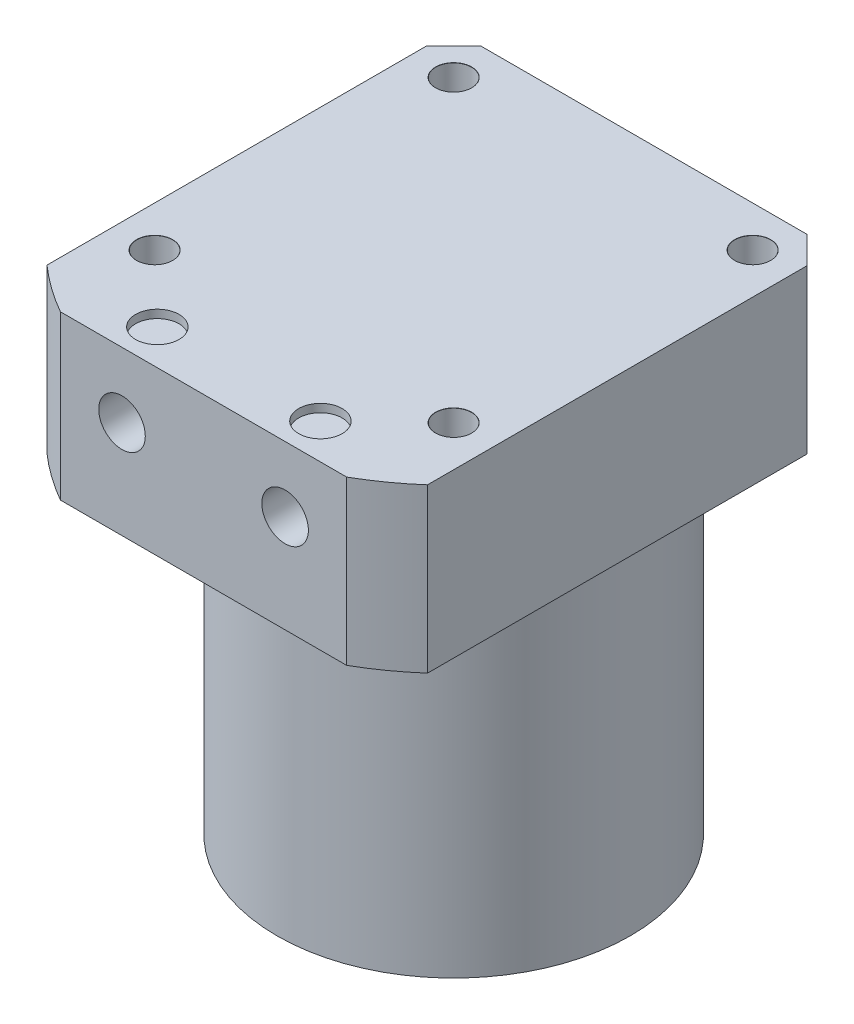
from build123d import *

# Parameters (mm, degrees)
SKETCH2_OUTSIDE_W                            = 143.282
SKETCH2_OUTSIDE_H                            = 143.282
SKETCH2_OUTSIDE_W_2                          = 70
SKETCH2_OUTSIDE_H_2                          = 81
CUT_EXTRUDE2_DEPTH                           = 120.444547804
CHAMFER1_SIZE                                = 5
F_8_0_8_DIAMETER_HOLE1_D                     = 8
F_8_0_8_DIAMETER_HOLE1_DEPTH                 = 1.5
G1_8_TAPPED_HOLE1_D                          = 8.566
G1_8_TAPPED_HOLE1_DEPTH                      = 22.18
CBORE_FOR_M6_HEX_SOCKET_HEAD_CAP_SCR_2_COUNT = 2
CBORE_FOR_M6_HEX_SOCKET_HEAD_CAP_SCR_2_PITCH = 55
CBORE_FOR_M6_HEX_SOCKET_HEAD_CAP_SCR_3_COUNT = 2
CBORE_FOR_M6_HEX_SOCKET_HEAD_CAP_SCR_3_PITCH = 77.781745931
CBORE_FOR_M6_HEX_SOCKET_HEAD_CAP_SCR_4_COUNT = 2
CBORE_FOR_M6_HEX_SOCKET_HEAD_CAP_SCR_4_PITCH = 55


with BuildPart() as part:
    # Sketch1 → Revolve1 (revolve)
    with BuildSketch(Plane.XY, mode=Mode.PRIVATE) as revolve1_sk:
        Polygon((0, 0), (-32.5, 0), (-32.5, 63), (-53, 63), (-53, 93), (0, 93), align=None)
    revolve(revolve1_sk.sketch.rotate(Axis((0, 87.050829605, 0), (0, -1, 0)), 270), axis=Axis((0, 87.050829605, 0), (0, -1, 0)))

    # Sketch2 outside → Cut-Extrude2 (cut, through all)
    with BuildSketch(Plane(origin=(0, 93, 0), x_dir=(1, 0, 0), z_dir=(0, 1, 0))):
        Rectangle(SKETCH2_OUTSIDE_W, SKETCH2_OUTSIDE_H)
        with Locations((0, -5.5)):
            Rectangle(SKETCH2_OUTSIDE_W_2, SKETCH2_OUTSIDE_H_2, mode=Mode.SUBTRACT)
    extrude(amount=-CUT_EXTRUDE2_DEPTH, mode=Mode.SUBTRACT)

    # Chamfer1
    chamfer1_edges = [part.edges().sort_by_distance(p)[0] for p in [
        (-35, 78, -35),
        (35, 78, -35),
    ]]
    chamfer(chamfer1_edges, length=CHAMFER1_SIZE)

    # 8.0 _8_ Diameter Hole1
    with Locations(Plane(origin=(-22.940510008, 93, 22.705104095), x_dir=(1, 0, 0), z_dir=(0, 1, 0))):
        with Locations((7.940510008, -16.794895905), (37.940510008, -16.794895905)):
            Hole(F_8_0_8_DIAMETER_HOLE1_D / 2, depth=F_8_0_8_DIAMETER_HOLE1_DEPTH)

    # G1_8 Tapped Hole1
    with Locations(Plane.XY.offset(46)):
        with Locations((-15, 81), (15, 81)):
            Hole(G1_8_TAPPED_HOLE1_D / 2, depth=G1_8_TAPPED_HOLE1_DEPTH)

    # Sketch7 → CBORE for M6 Hex Socket Head Cap Screw1 (revolve, cut)
    with BuildSketch(Plane(origin=(-27.5, 63, -27.5), x_dir=(0, 0, -1), z_dir=(1, 0, 0))):
        Polygon((0, 0), (0, 30), (3.325, 30), (3.3, 29.975), (3.3, 6), (5.5, 6), (5.5, 0), align=None)
    cbore_for_m6_hex_socket_head_cap_screw1 = revolve(axis=Axis((-27.5, 56.65, -27.5), (0, 1, 0)), mode=Mode.SUBTRACT)

    # CBORE for M6 Hex Socket Head Cap Scr 2: CBORE for M6 Hex Socket Head Cap Screw1 ×2
    with Locations(*[(i * CBORE_FOR_M6_HEX_SOCKET_HEAD_CAP_SCR_2_PITCH, 0, 0) for i in range(1, CBORE_FOR_M6_HEX_SOCKET_HEAD_CAP_SCR_2_COUNT)]):
        add(cbore_for_m6_hex_socket_head_cap_screw1, mode=Mode.SUBTRACT)

    # CBORE for M6 Hex Socket Head Cap Scr 3: CBORE for M6 Hex Socket Head Cap Screw1 ×2
    with Locations(*[Vector(0.7071067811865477, 0, 0.7071067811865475) * (i * CBORE_FOR_M6_HEX_SOCKET_HEAD_CAP_SCR_3_PITCH) for i in range(1, CBORE_FOR_M6_HEX_SOCKET_HEAD_CAP_SCR_3_COUNT)]):
        add(cbore_for_m6_hex_socket_head_cap_screw1, mode=Mode.SUBTRACT)

    # CBORE for M6 Hex Socket Head Cap Scr 4: CBORE for M6 Hex Socket Head Cap Screw1 ×2
    with Locations(*[(0, 0, i * CBORE_FOR_M6_HEX_SOCKET_HEAD_CAP_SCR_4_PITCH) for i in range(1, CBORE_FOR_M6_HEX_SOCKET_HEAD_CAP_SCR_4_COUNT)]):
        add(cbore_for_m6_hex_socket_head_cap_screw1, mode=Mode.SUBTRACT)


solid = part.part
